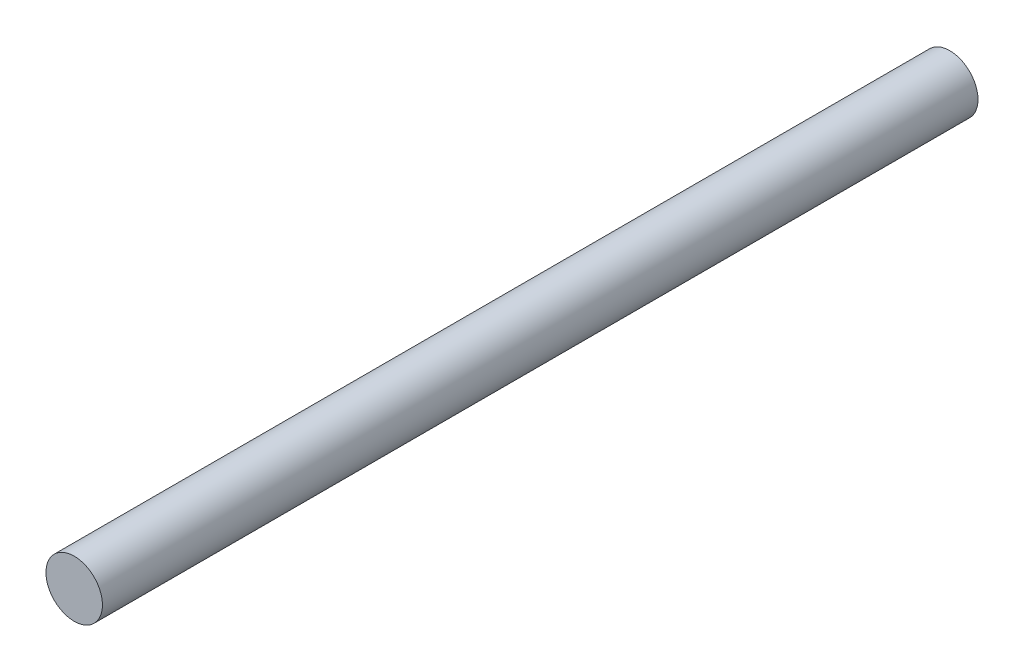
from build123d import *

# Parameters (mm, degrees)
SKETCH1_R           = 3.175
BOSS_EXTRUDE1_DEPTH = 98.425


with BuildPart() as part:
    # Sketch1 → Boss-Extrude1 (new body)
    with BuildSketch(Plane.XY):
        with Locations((-51.908663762, 20.029973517)):
            Circle(SKETCH1_R)
    extrude(amount=BOSS_EXTRUDE1_DEPTH)


solid = part.part
